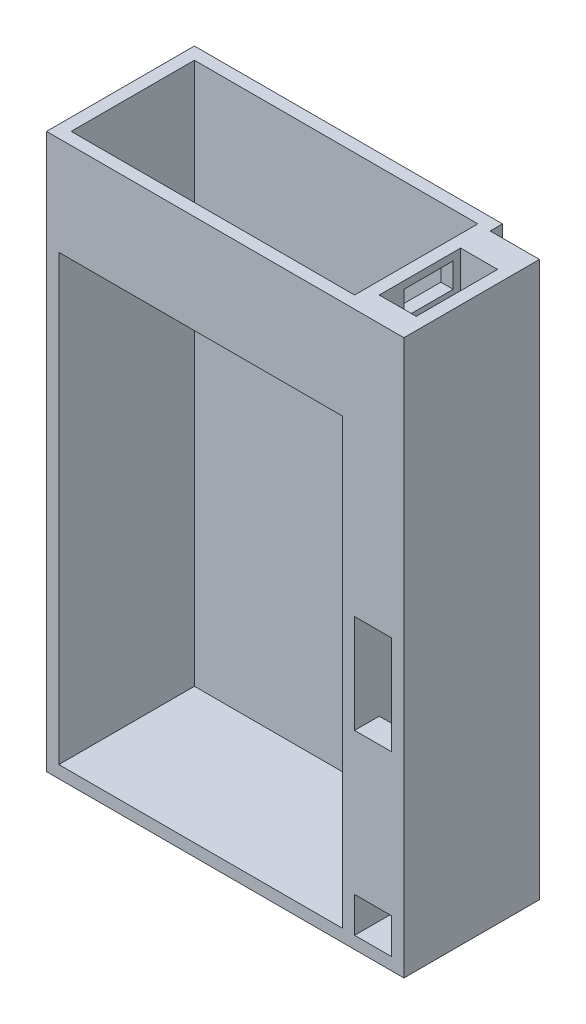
from build123d import *

# Parameters (mm, degrees)
BOSS_EXTRUDE1_DEPTH = 55
SKETCH2_W           = 125
SKETCH2_H           = 225
BOSS_EXTRUDE2_DEPTH = 5
SKETCH3_W           = 125
SKETCH3_H           = 40
BOSS_EXTRUDE3_DEPTH = 5
SKETCH6_W           = 20
SKETCH6_H           = 10
CUT_EXTRUDE1_DEPTH  = 5
SKETCH7_W           = 20
SKETCH7_H           = 225
BOSS_EXTRUDE4_DEPTH = 12
BOSS_EXTRUDE5_DEPTH = 43
SKETCH9_W           = 15
SKETCH9_H           = 57.634438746
BOSS_EXTRUDE6_DEPTH = 10


with BuildPart() as part:
    # Sketch1 → Boss-Extrude1 (new body)
    with BuildSketch(Plane.XY):
        Polygon((62.5, -112.5), (62.5, 112.5), (57.5, 112.5), (57.5, 107.5), (57.5, -107.5), (-57.5, -107.5), (-57.5, 107.5), (-57.5, 112.5), (-62.5, 112.5), (-62.5, -112.5), align=None)
    extrude(amount=BOSS_EXTRUDE1_DEPTH)

    # Sketch2 → Boss-Extrude2 (add)
    with BuildSketch(Plane.XY):
        Rectangle(SKETCH2_W, SKETCH2_H)
    extrude(amount=-BOSS_EXTRUDE2_DEPTH)

    # Sketch3 → Boss-Extrude3 (add)
    with BuildSketch(Plane.XY.offset(55)):
        with Locations((0, 92.5)):
            Rectangle(SKETCH3_W, SKETCH3_H)
    extrude(amount=-BOSS_EXTRUDE3_DEPTH)

    # Sketch6 → Cut-Extrude1 (cut)
    with BuildSketch(Plane(origin=(62.5, 0, 0), x_dir=(0, 0, -1), z_dir=(1, 0, 0))):
        with Locations((-25, 104.5)):
            Rectangle(SKETCH6_W, SKETCH6_H)
    extrude(amount=-CUT_EXTRUDE1_DEPTH, mode=Mode.SUBTRACT)

    # Sketch7 → Boss-Extrude4 (add)
    with BuildSketch(Plane.XY):
        with Locations((72.5, 0)):
            Rectangle(SKETCH7_W, SKETCH7_H)
    extrude(amount=BOSS_EXTRUDE4_DEPTH)

    # Sketch8 → Boss-Extrude5 (add)
    with BuildSketch(Plane.XY.offset(12)):
        Polygon((62.5, -112.5), (82.5, -112.5), (82.5, 112.5), (77.5, 112.5), (77.5, -107.5), (62.5, -107.5), align=None)
    extrude(amount=BOSS_EXTRUDE5_DEPTH)

    # Sketch9 → Boss-Extrude6 (add)
    with BuildSketch(Plane.XY.offset(55)):
        with Locations((70, -64.317219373)):
            Rectangle(SKETCH9_W, SKETCH9_H)
        Polygon((62.5, 99.5), (62.5, 4.5), (77.5, 4.5), (77.5, 112.5), (62.5, 112.5), align=None)
    extrude(amount=-BOSS_EXTRUDE6_DEPTH)


solid = part.part
